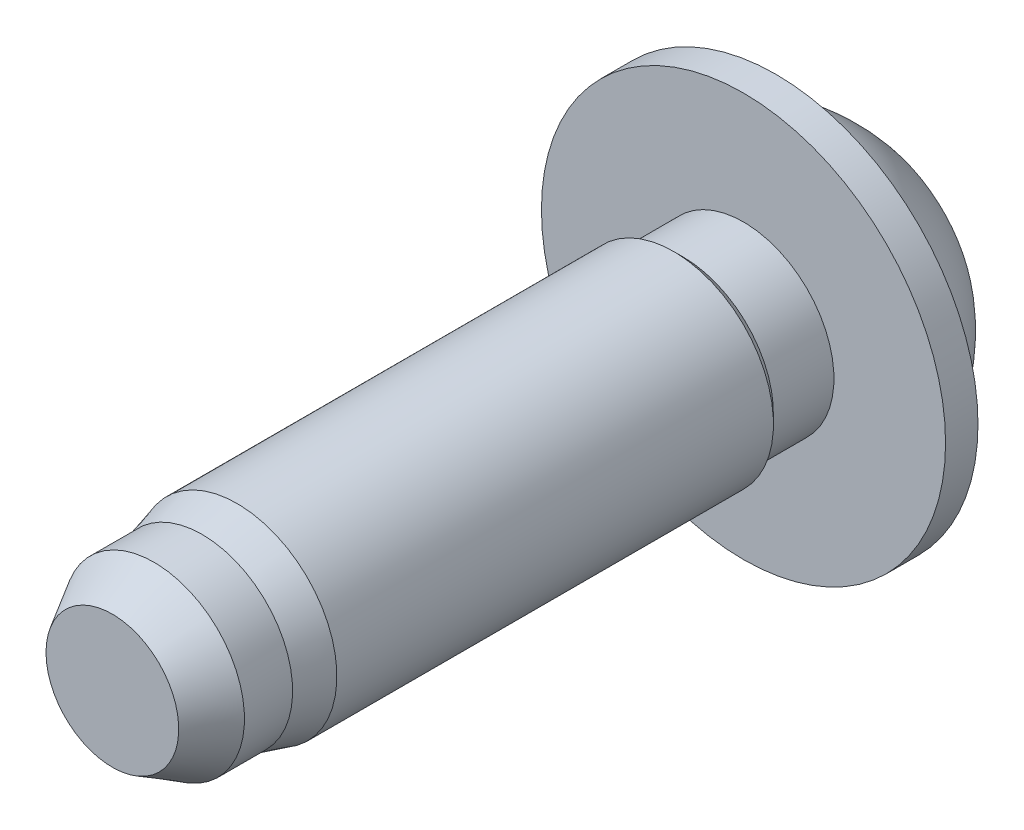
ISO-10303-21;
HEADER;
FILE_DESCRIPTION(('STEP AP214'),'2;1');
FILE_NAME('part.step','',(''),(''),'','','');
FILE_SCHEMA(('AUTOMOTIVE_DESIGN { 1 0 10303 214 1 1 1 1 }'));
ENDSEC;
DATA;
#1=APPLICATION_CONTEXT('core data for automotive mechanical design processes');
#2=APPLICATION_PROTOCOL_DEFINITION('international standard','automotive_design',2000,#1);
#3=PRODUCT_CONTEXT('',#1,'mechanical');
#4=PRODUCT('Part','Part','',(#3));
#5=PRODUCT_RELATED_PRODUCT_CATEGORY('part','',(#4));
#6=PRODUCT_DEFINITION_FORMATION('','',#4);
#7=PRODUCT_DEFINITION_CONTEXT('part definition',#1,'design');
#8=PRODUCT_DEFINITION('design','',#6,#7);
#9=PRODUCT_DEFINITION_SHAPE('','',#8);
#10=(LENGTH_UNIT() NAMED_UNIT(*) SI_UNIT(.MILLI.,.METRE.));
#11=(NAMED_UNIT(*) PLANE_ANGLE_UNIT() SI_UNIT($,.RADIAN.));
#12=(NAMED_UNIT(*) SI_UNIT($,.STERADIAN.) SOLID_ANGLE_UNIT());
#13=UNCERTAINTY_MEASURE_WITH_UNIT(LENGTH_MEASURE(1.E-05),#10,'distance_accuracy_value','');
#14=(GEOMETRIC_REPRESENTATION_CONTEXT(3) GLOBAL_UNCERTAINTY_ASSIGNED_CONTEXT((#13)) GLOBAL_UNIT_ASSIGNED_CONTEXT((#10,
#11,#12)) REPRESENTATION_CONTEXT('',''));
#15=CARTESIAN_POINT('',(0.,0.,0.));
#16=DIRECTION('',(0.,0.,1.));
#17=DIRECTION('',(1.,0.,0.));
#18=AXIS2_PLACEMENT_3D('',#15,#16,#17);
#19=CARTESIAN_POINT('',(0.,2.125,-7.2));
#20=DIRECTION('',(0.,0.,-1.));
#21=DIRECTION('',(-1.,0.,0.));
#22=AXIS2_PLACEMENT_3D('',#19,#20,#21);
#23=PLANE('',#22);
#24=CARTESIAN_POINT('',(0.,4.25000000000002,-7.2));
#25=CARTESIAN_POINT('',(-0.238744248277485,4.2499894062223,-7.2));
#26=CARTESIAN_POINT('',(-0.47764761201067,4.22981662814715,-7.2));
#27=CARTESIAN_POINT('',(-0.948858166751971,4.14962735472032,-7.2));
#28=CARTESIAN_POINT('',(-1.18115777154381,4.08956682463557,-7.2));
#29=CARTESIAN_POINT('',(-1.6322946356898,3.93131128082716,-7.2));
#30=CARTESIAN_POINT('',(-1.85113752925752,3.83313235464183,-7.2));
#31=CARTESIAN_POINT('',(-2.26917057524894,3.60145311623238,-7.2));
#32=CARTESIAN_POINT('',(-2.46836585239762,3.46796204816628,-7.2));
#33=CARTESIAN_POINT('',(-2.84152308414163,3.16943800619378,-7.2));
#34=CARTESIAN_POINT('',(-3.01548503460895,3.00440502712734,-7.2));
#35=CARTESIAN_POINT('',(-3.33327895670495,2.64742616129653,-7.2));
#36=CARTESIAN_POINT('',(-3.47710304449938,2.45547325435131,-7.2));
#37=CARTESIAN_POINT('',(-3.73053094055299,2.05008024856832,-7.2));
#38=CARTESIAN_POINT('',(-3.8401203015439,1.83663112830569,-7.2));
#39=CARTESIAN_POINT('',(-4.02179290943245,1.39451740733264,-7.2));
#40=CARTESIAN_POINT('',(-4.09391741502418,1.16586985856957,-7.2));
#41=CARTESIAN_POINT('',(-4.18076600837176,0.779963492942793,-7.2));
#42=CARTESIAN_POINT('',(-4.20669445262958,0.625133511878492,-7.2));
#43=CARTESIAN_POINT('',(-4.24131464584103,0.313558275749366,-7.2));
#44=CARTESIAN_POINT('',(-4.25000641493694,0.156813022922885,-7.2));
#45=CARTESIAN_POINT('',(-4.24999023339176,-0.238744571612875,-7.19999999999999));
#46=CARTESIAN_POINT('',(-4.22981857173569,-0.477646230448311,-7.2));
#47=CARTESIAN_POINT('',(-4.1496252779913,-0.948860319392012,-7.2));
#48=CARTESIAN_POINT('',(-4.08955966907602,-1.181165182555,-7.2));
#49=CARTESIAN_POINT('',(-3.93131975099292,-1.63228347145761,-7.2));
#50=CARTESIAN_POINT('',(-3.83316215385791,-1.85110276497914,-7.2));
#51=CARTESIAN_POINT('',(-3.60143144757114,-2.26919067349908,-7.2));
#52=CARTESIAN_POINT('',(-3.46786636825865,-2.46846370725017,-7.2));
#53=CARTESIAN_POINT('',(-3.24402964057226,-2.74829388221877,-7.2));
#54=CARTESIAN_POINT('',(-3.16544980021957,-2.83843775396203,-7.2));
#55=CARTESIAN_POINT('',(-3.00098730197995,-3.01178048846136,-7.2));
#56=CARTESIAN_POINT('',(-2.91510734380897,-3.09498189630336,-7.2));
#57=CARTESIAN_POINT('',(-2.73661338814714,-3.25388042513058,-7.2));
#58=CARTESIAN_POINT('',(-2.64399667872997,-3.32957449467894,-7.2));
#59=CARTESIAN_POINT('',(-2.45274881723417,-3.47286516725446,-7.2));
#60=CARTESIAN_POINT('',(-2.35411989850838,-3.54046474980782,-7.2));
#61=CARTESIAN_POINT('',(-2.15148327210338,-3.66713818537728,-7.2));
#62=CARTESIAN_POINT('',(-2.04747367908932,-3.72620902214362,-7.2));
#63=CARTESIAN_POINT('',(-1.83488638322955,-3.835356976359,-7.2));
#64=CARTESIAN_POINT('',(-1.72631038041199,-3.88543740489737,-7.2));
#65=CARTESIAN_POINT('',(-1.50528555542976,-3.97629190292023,-7.2));
#66=CARTESIAN_POINT('',(-1.39283532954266,-4.01706255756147,-7.2));
#67=CARTESIAN_POINT('',(-1.16494164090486,-4.08897081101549,-7.2));
#68=CARTESIAN_POINT('',(-1.04949929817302,-4.12011195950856,-7.2));
#69=CARTESIAN_POINT('',(-0.816358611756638,-4.17257001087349,-7.2));
#70=CARTESIAN_POINT('',(-0.698659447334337,-4.19388326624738,-7.2));
#71=CARTESIAN_POINT('',(-0.461927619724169,-4.22651088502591,-7.2));
#72=CARTESIAN_POINT('',(-0.342895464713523,-4.23782893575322,-7.2));
#73=CARTESIAN_POINT('',(-0.104256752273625,-4.25040143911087,-7.2));
#74=CARTESIAN_POINT('',(0.0153500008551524,-4.25165217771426,-7.2));
#75=CARTESIAN_POINT('',(0.25419940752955,-4.24407281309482,-7.2));
#76=CARTESIAN_POINT('',(0.373442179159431,-4.23524643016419,-7.2));
#77=CARTESIAN_POINT('',(0.610803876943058,-4.20757653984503,-7.2));
#78=CARTESIAN_POINT('',(0.728922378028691,-4.18872938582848,-7.2));
#79=CARTESIAN_POINT('',(0.963108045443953,-4.1411585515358,-7.2));
#80=CARTESIAN_POINT('',(1.07917595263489,-4.11243851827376,-7.2));
#81=CARTESIAN_POINT('',(1.30852390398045,-4.04531174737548,-7.2));
#82=CARTESIAN_POINT('',(1.42180287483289,-4.00690134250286,-7.2));
#83=CARTESIAN_POINT('',(1.64468041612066,-3.92068846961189,-7.2));
#84=CARTESIAN_POINT('',(1.75428032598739,-3.87288946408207,-7.2));
#85=CARTESIAN_POINT('',(1.96910137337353,-3.76821181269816,-7.2));
#86=CARTESIAN_POINT('',(2.07432101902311,-3.71133010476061,-7.2));
#87=CARTESIAN_POINT('',(2.27956855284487,-3.58891958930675,-7.2));
#88=CARTESIAN_POINT('',(2.37959763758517,-3.52339278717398,-7.2));
#89=CARTESIAN_POINT('',(2.57374111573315,-3.38417083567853,-7.2));
#90=CARTESIAN_POINT('',(2.66785816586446,-3.31047939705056,-7.2));
#91=CARTESIAN_POINT('',(2.84962413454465,-3.15538397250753,-7.2));
#92=CARTESIAN_POINT('',(2.93726672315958,-3.07397261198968,-7.2));
#93=CARTESIAN_POINT('',(3.18931001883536,-2.8191748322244,-7.2));
#94=CARTESIAN_POINT('',(3.34308353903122,-2.63503983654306,-7.2));
#95=CARTESIAN_POINT('',(3.61747777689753,-2.24354460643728,-7.2));
#96=CARTESIAN_POINT('',(3.73809975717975,-2.03618525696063,-7.2));
#97=CARTESIAN_POINT('',(3.89167461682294,-1.71223309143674,-7.2));
#98=CARTESIAN_POINT('',(3.93834574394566,-1.60195786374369,-7.2));
#99=CARTESIAN_POINT('',(4.02219976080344,-1.37792725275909,-7.2));
#100=CARTESIAN_POINT('',(4.05939032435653,-1.26417476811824,-7.2));
#101=CARTESIAN_POINT('',(4.12399424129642,-1.03413266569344,-7.2));
#102=CARTESIAN_POINT('',(4.15142302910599,-0.917847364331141,-7.2));
#103=CARTESIAN_POINT('',(4.19639104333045,-0.683402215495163,-7.2));
#104=CARTESIAN_POINT('',(4.21393321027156,-0.56524293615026,-7.2));
#105=CARTESIAN_POINT('',(4.23430872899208,-0.372417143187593,-7.2));
#106=CARTESIAN_POINT('',(4.24019110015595,-0.298059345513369,-7.2));
#107=CARTESIAN_POINT('',(4.2480369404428,-0.14913717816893,-7.2));
#108=CARTESIAN_POINT('',(4.25000040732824,-0.0745728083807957,-7.2));
#109=CARTESIAN_POINT('',(4.24999934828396,0.119314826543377,-7.2));
#110=CARTESIAN_POINT('',(4.24497131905,0.23865125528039,-7.2));
#111=CARTESIAN_POINT('',(4.22488837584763,0.476524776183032,-7.2));
#112=CARTESIAN_POINT('',(4.20982854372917,0.59506144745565,-7.2));
#113=CARTESIAN_POINT('',(4.1697503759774,0.830651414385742,-7.2));
#114=CARTESIAN_POINT('',(4.14471502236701,0.94770182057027,-7.2));
#115=CARTESIAN_POINT('',(4.08485288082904,1.17931772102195,-7.2));
#116=CARTESIAN_POINT('',(4.05002240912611,1.29388226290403,-7.2));
#117=CARTESIAN_POINT('',(3.97086945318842,1.51953092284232,-7.2));
#118=CARTESIAN_POINT('',(3.9265583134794,1.63061902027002,-7.2));
#119=CARTESIAN_POINT('',(3.82871649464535,1.84870744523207,-7.2));
#120=CARTESIAN_POINT('',(3.77518241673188,1.95570624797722,-7.2));
#121=CARTESIAN_POINT('',(3.65933780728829,2.16471958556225,-7.2));
#122=CARTESIAN_POINT('',(3.5970350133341,2.26673840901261,-7.2));
#123=CARTESIAN_POINT('',(3.46403577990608,2.46520403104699,-7.2));
#124=CARTESIAN_POINT('',(3.39333625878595,2.56164876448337,-7.2));
#125=CARTESIAN_POINT('',(3.24408411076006,2.74821477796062,-7.2));
#126=CARTESIAN_POINT('',(3.16553362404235,2.83833776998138,-7.2));
#127=CARTESIAN_POINT('',(3.00109355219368,3.01168011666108,-7.2));
#128=CARTESIAN_POINT('',(2.91520124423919,3.09489688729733,-7.2));
#129=CARTESIAN_POINT('',(2.73670818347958,3.25379745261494,-7.2));
#130=CARTESIAN_POINT('',(2.64410778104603,3.32948164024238,-7.2));
#131=CARTESIAN_POINT('',(2.45285580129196,3.47279461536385,-7.2));
#132=CARTESIAN_POINT('',(2.3542020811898,3.54042052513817,-7.2));
#133=CARTESIAN_POINT('',(2.05018949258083,3.73044527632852,-7.2));
#134=CARTESIAN_POINT('',(1.83665846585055,3.84009841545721,-7.2));
#135=CARTESIAN_POINT('',(1.39448653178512,4.02181623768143,-7.2));
#136=CARTESIAN_POINT('',(1.16586268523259,4.09392257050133,-7.2));
#137=CARTESIAN_POINT('',(0.779967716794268,4.1807627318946,-7.2));
#138=CARTESIAN_POINT('',(0.625134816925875,4.20669346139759,-7.2));
#139=CARTESIAN_POINT('',(0.313557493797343,4.24131557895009,-7.2));
#140=CARTESIAN_POINT('',(0.156813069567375,4.25000695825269,-7.2));
#141=CARTESIAN_POINT('',(0.,4.25000000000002,-7.2));
#142=B_SPLINE_CURVE_WITH_KNOTS('',3,(#24,#25,#26,#27,#28,#29,#30,#31,#32,#33,#34,#35,#36,#37,
#38,#39,#40,#41,#42,#43,#44,#45,#46,#47,#48,#49,#50,#51,#52,#53,#54,#55,#56,#57,#58,#59,#60,#61,
#62,#63,#64,#65,#66,#67,#68,#69,#70,#71,#72,#73,#74,#75,#76,#77,#78,#79,#80,#81,#82,#83,#84,#85,
#86,#87,#88,#89,#90,#91,#92,#93,#94,#95,#96,#97,#98,#99,#100,#101,#102,#103,#104,#105,#106,#107,
#108,#109,#110,#111,#112,#113,#114,#115,#116,#117,#118,#119,#120,#121,#122,#123,#124,#125,#126,
#127,#128,#129,#130,#131,#132,#133,#134,#135,#136,#137,#138,#139,#140,#141),.UNSPECIFIED.,.T.,
.F.,(4,2,2,2,2,2,2,2,2,2,2,2,2,2,2,2,2,2,2,2,2,2,2,2,2,2,2,2,2,2,2,2,2,2,2,2,2,2,2,2,2,2,2,2,2,
2,2,2,2,2,2,2,2,2,2,2,2,2,4),(0.,0.715663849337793,1.43211908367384,2.14827227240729,
2.864238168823,3.58020418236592,4.29635725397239,5.01281213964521,5.72847633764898,
6.19854203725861,6.66860718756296,7.38427161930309,8.1007262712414,8.81686694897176,
9.53284535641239,9.89125327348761,10.2495292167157,10.6079501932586,10.9662388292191,
11.3246538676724,11.682936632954,12.041350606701,12.3996323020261,12.7580468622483,
13.1163291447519,13.4747435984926,13.8330257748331,14.1914384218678,14.5497188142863,
14.9081349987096,15.2664192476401,15.6248245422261,15.9831468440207,16.3413069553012,
16.6998127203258,17.4158859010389,18.1319318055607,18.4908101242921,18.8493970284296,
19.2074144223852,19.5653252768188,19.789000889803,20.0126766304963,20.3705528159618,
20.7286045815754,21.087269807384,21.4460701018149,21.8044434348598,22.1629491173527,
22.5211404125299,22.8794635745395,23.2376893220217,23.5960485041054,23.95438898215,
24.3128570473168,25.0293148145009,25.7449761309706,26.2150414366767,26.6851069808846),.UNSPECIFIED.);
#143=CARTESIAN_POINT('',(0.,4.25000000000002,-7.2));
#144=VERTEX_POINT('',#143);
#145=EDGE_CURVE('E17',#144,#144,#142,.T.);
#146=ORIENTED_EDGE('',*,*,#145,.F.);
#147=EDGE_LOOP('',(#146));
#148=FACE_BOUND('',#147,.T.);
#149=ADVANCED_FACE('F13',(#148),#23,.T.);
#150=CARTESIAN_POINT('',(0.,0.,-1.9043918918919));
#151=DIRECTION('',(1.,0.,0.));
#152=DIRECTION('',(0.,1.,0.));
#153=AXIS2_PLACEMENT_3D('',#150,#151,#152);
#154=SPHERICAL_SURFACE('',#153,6.79013735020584);
#155=ORIENTED_EDGE('',*,*,#145,.T.);
#156=EDGE_LOOP('',(#155));
#157=FACE_BOUND('',#156,.T.);
#158=CARTESIAN_POINT('',(-6.60000000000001,0.,-3.5));
#159=CARTESIAN_POINT('',(-6.60000071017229,-0.227884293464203,-3.5));
#160=CARTESIAN_POINT('',(-6.58818888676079,-0.455757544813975,-3.5));
#161=CARTESIAN_POINT('',(-6.54104360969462,-0.909253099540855,-3.5));
#162=CARTESIAN_POINT('',(-6.50569252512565,-1.13487358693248,-3.5));
#163=CARTESIAN_POINT('',(-6.42061817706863,-1.53950406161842,-3.5));
#164=CARTESIAN_POINT('',(-6.37481221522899,-1.7193493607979,-3.5));
#165=CARTESIAN_POINT('',(-6.26820682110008,-2.07460235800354,-3.5));
#166=CARTESIAN_POINT('',(-6.20740357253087,-2.25000891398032,-3.5));
#167=CARTESIAN_POINT('',(-6.07119211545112,-2.59520398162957,-3.5));
#168=CARTESIAN_POINT('',(-5.9957730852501,-2.76498822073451,-3.5));
#169=CARTESIAN_POINT('',(-5.83086504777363,-3.09765883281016,-3.5));
#170=CARTESIAN_POINT('',(-5.74137090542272,-3.26054266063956,-3.5));
#171=CARTESIAN_POINT('',(-5.54904489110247,-3.57806181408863,-3.5));
#172=CARTESIAN_POINT('',(-5.44622346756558,-3.73270346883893,-3.5));
#173=CARTESIAN_POINT('',(-5.22787926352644,-4.03283134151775,-3.5));
#174=CARTESIAN_POINT('',(-5.11235181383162,-4.1783141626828,-3.5));
#175=CARTESIAN_POINT('',(-4.869520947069,-4.45894328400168,-3.5));
#176=CARTESIAN_POINT('',(-4.74222459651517,-4.59409569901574,-3.5));
#177=CARTESIAN_POINT('',(-4.47665287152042,-4.85324774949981,-3.5));
#178=CARTESIAN_POINT('',(-4.33837346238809,-4.97724325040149,-3.5));
#179=CARTESIAN_POINT('',(-4.05189928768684,-5.21311116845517,-3.5));
#180=CARTESIAN_POINT('',(-3.90370725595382,-5.32498690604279,-3.5));
#181=CARTESIAN_POINT('',(-3.59837055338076,-5.53589835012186,-3.5));
#182=CARTESIAN_POINT('',(-3.44122259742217,-5.63492930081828,-3.5));
#183=CARTESIAN_POINT('',(-3.1191946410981,-5.81936795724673,-3.5));
#184=CARTESIAN_POINT('',(-2.95431720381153,-5.90478013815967,-3.5));
#185=CARTESIAN_POINT('',(-2.61789209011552,-6.06144247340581,-3.5));
#186=CARTESIAN_POINT('',(-2.44634198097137,-6.13268740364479,-3.5));
#187=CARTESIAN_POINT('',(-2.09788587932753,-6.26045558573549,-3.5));
#188=CARTESIAN_POINT('',(-1.9209810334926,-6.31698196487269,-3.5));
#189=CARTESIAN_POINT('',(-1.56303448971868,-6.41493210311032,-3.5));
#190=CARTESIAN_POINT('',(-1.38199270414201,-6.45635554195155,-3.5));
#191=CARTESIAN_POINT('',(-1.01706554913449,-6.52380314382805,-3.5));
#192=CARTESIAN_POINT('',(-0.833180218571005,-6.54982751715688,-3.5));
#193=CARTESIAN_POINT('',(-0.463870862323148,-6.5862928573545,-3.5));
#194=CARTESIAN_POINT('',(-0.27844683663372,-6.59673382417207,-3.5));
#195=CARTESIAN_POINT('',(0.0926237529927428,-6.6019581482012,-3.5));
#196=CARTESIAN_POINT('',(0.278270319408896,-6.59674132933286,-3.5));
#197=CARTESIAN_POINT('',(0.648460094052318,-6.57068707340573,-3.5));
#198=CARTESIAN_POINT('',(0.833003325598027,-6.54984996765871,-3.5));
#199=CARTESIAN_POINT('',(1.19971452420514,-6.49269802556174,-3.5));
#200=CARTESIAN_POINT('',(1.3818820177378,-6.45638015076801,-3.5));
#201=CARTESIAN_POINT('',(1.74244271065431,-6.36854070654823,-3.5));
#202=CARTESIAN_POINT('',(1.92083727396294,-6.31702473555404,-3.5));
#203=CARTESIAN_POINT('',(2.27272071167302,-6.19912768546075,-3.5));
#204=CARTESIAN_POINT('',(2.44620768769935,-6.13274094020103,-3.5));
#205=CARTESIAN_POINT('',(2.78690803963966,-5.98561289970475,-3.5));
#206=CARTESIAN_POINT('',(2.95412370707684,-5.9048769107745,-3.5));
#207=CARTESIAN_POINT('',(3.2812165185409,-5.72957762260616,-3.5));
#208=CARTESIAN_POINT('',(3.44109113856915,-5.63500961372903,-3.5));
#209=CARTESIAN_POINT('',(3.75224636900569,-5.43277677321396,-3.5));
#210=CARTESIAN_POINT('',(3.90353012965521,-5.32511678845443,-3.5));
#211=CARTESIAN_POINT('',(4.19653659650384,-5.09740301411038,-3.5));
#212=CARTESIAN_POINT('',(4.33825640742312,-4.97734549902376,-3.5));
#213=CARTESIAN_POINT('',(4.61102678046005,-4.72576381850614,-3.5));
#214=CARTESIAN_POINT('',(4.74208125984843,-4.59424390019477,-3.5));
#215=CARTESIAN_POINT('',(4.99271480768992,-4.32056095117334,-3.5));
#216=CARTESIAN_POINT('',(5.11228772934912,-4.17839229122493,-3.5));
#217=CARTESIAN_POINT('',(5.33898663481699,-3.88453919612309,-3.5));
#218=CARTESIAN_POINT('',(5.44611719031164,-3.73285828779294,-3.5));
#219=CARTESIAN_POINT('',(5.64727496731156,-3.42092745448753,-3.5));
#220=CARTESIAN_POINT('',(5.74129512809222,-3.26067297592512,-3.5));
#221=CARTESIAN_POINT('',(5.91548484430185,-2.93283012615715,-3.5));
#222=CARTESIAN_POINT('',(5.99565597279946,-2.76524259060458,-3.5));
#223=CARTESIAN_POINT('',(6.14152347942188,-2.4240613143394,-3.5));
#224=CARTESIAN_POINT('',(6.2072331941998,-2.25047327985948,-3.5));
#225=CARTESIAN_POINT('',(6.32382960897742,-1.89831751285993,-3.5));
#226=CARTESIAN_POINT('',(6.37470949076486,-1.71974753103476,-3.5));
#227=CARTESIAN_POINT('',(6.47837235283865,-1.28751927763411,-3.5));
#228=CARTESIAN_POINT('',(6.5239463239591,-1.03210079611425,-3.5));
#229=CARTESIAN_POINT('',(6.58475244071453,-0.517743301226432,-3.5));
#230=CARTESIAN_POINT('',(6.59999635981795,-0.258805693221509,-3.5));
#231=CARTESIAN_POINT('',(6.60000160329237,0.113989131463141,-3.5));
#232=CARTESIAN_POINT('',(6.59704674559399,0.227952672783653,-3.5));
#233=CARTESIAN_POINT('',(6.58524680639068,0.455521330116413,-3.5));
#234=CARTESIAN_POINT('',(6.57640450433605,0.569126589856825,-3.5));
#235=CARTESIAN_POINT('',(6.54104367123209,0.909224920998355,-3.5));
#236=CARTESIAN_POINT('',(6.50569123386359,1.13487175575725,-3.5));
#237=CARTESIAN_POINT('',(6.42061796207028,1.53951156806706,-3.5));
#238=CARTESIAN_POINT('',(6.3748130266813,1.71934805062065,-3.5));
#239=CARTESIAN_POINT('',(6.26820963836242,2.07459157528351,-3.5));
#240=CARTESIAN_POINT('',(6.20740742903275,2.24999749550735,-3.5));
#241=CARTESIAN_POINT('',(6.07119666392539,2.59519410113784,-3.5));
#242=CARTESIAN_POINT('',(5.99577686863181,2.7649803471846,-3.5));
#243=CARTESIAN_POINT('',(5.83086708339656,3.09765496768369,-3.5));
#244=CARTESIAN_POINT('',(5.74137199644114,3.26054081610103,-3.5));
#245=CARTESIAN_POINT('',(5.54904347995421,3.57806418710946,-3.5));
#246=CARTESIAN_POINT('',(5.44622045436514,3.73270801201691,-3.5));
#247=CARTESIAN_POINT('',(5.22787274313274,4.03283990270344,-3.5));
#248=CARTESIAN_POINT('',(5.11234339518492,4.17832457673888,-3.5));
#249=CARTESIAN_POINT('',(4.86951197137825,4.45895297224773,-3.5));
#250=CARTESIAN_POINT('',(4.74221730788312,4.59410310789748,-3.5));
#251=CARTESIAN_POINT('',(4.47664910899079,4.85325112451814,-3.5));
#252=CARTESIAN_POINT('',(4.33837152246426,4.97724485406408,-3.5));
#253=CARTESIAN_POINT('',(4.05190841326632,5.2131036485,-3.5));
#254=CARTESIAN_POINT('',(3.90372612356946,5.32497264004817,-3.5));
#255=CARTESIAN_POINT('',(3.59841111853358,5.53587156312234,-3.5));
#256=CARTESIAN_POINT('',(3.44127517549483,5.63489682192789,-3.5));
#257=CARTESIAN_POINT('',(3.11922253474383,5.81935434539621,-3.5));
#258=CARTESIAN_POINT('',(2.95430603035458,5.9047869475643,-3.5));
#259=CARTESIAN_POINT('',(2.61785822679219,6.06145663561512,-3.5));
#260=CARTESIAN_POINT('',(2.44632670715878,6.13269324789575,-3.5));
#261=CARTESIAN_POINT('',(2.09062229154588,6.26311866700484,-3.5));
#262=CARTESIAN_POINT('',(1.90622030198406,6.3216836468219,-3.5));
#263=CARTESIAN_POINT('',(1.53297909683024,6.42240939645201,-3.5));
#264=CARTESIAN_POINT('',(1.34413960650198,6.46456914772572,-3.5));
#265=CARTESIAN_POINT('',(0.963526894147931,6.53214872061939,-3.5));
#266=CARTESIAN_POINT('',(0.771754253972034,6.55757181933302,-3.5));
#267=CARTESIAN_POINT('',(0.38665329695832,6.59150008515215,-3.5));
#268=CARTESIAN_POINT('',(0.193324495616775,6.59999976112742,-3.5));
#269=CARTESIAN_POINT('',(-0.185568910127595,6.60000022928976,-3.5));
#270=CARTESIAN_POINT('',(-0.371133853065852,6.59216928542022,-3.5));
#271=CARTESIAN_POINT('',(-0.74094342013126,6.56090199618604,-3.5));
#272=CARTESIAN_POINT('',(-0.925188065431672,6.53746590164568,-3.5));
#273=CARTESIAN_POINT('',(-1.29105595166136,6.4751534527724,-3.5));
#274=CARTESIAN_POINT('',(-1.47267906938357,6.43627637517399,-3.5));
#275=CARTESIAN_POINT('',(-1.83194299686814,6.34337436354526,-3.5));
#276=CARTESIAN_POINT('',(-2.00958514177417,6.28935459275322,-3.5));
#277=CARTESIAN_POINT('',(-2.35976314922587,6.16651934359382,-3.5));
#278=CARTESIAN_POINT('',(-2.53229680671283,6.09769757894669,-3.5));
#279=CARTESIAN_POINT('',(-2.87088894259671,5.94578961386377,-3.5));
#280=CARTESIAN_POINT('',(-3.0369497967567,5.86270870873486,-3.5));
#281=CARTESIAN_POINT('',(-3.36154253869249,5.68282271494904,-3.5));
#282=CARTESIAN_POINT('',(-3.52007168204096,5.58601267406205,-3.5));
#283=CARTESIAN_POINT('',(-3.82835233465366,5.37941775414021,-3.5));
#284=CARTESIAN_POINT('',(-3.97810705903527,5.26963767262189,-3.5));
#285=CARTESIAN_POINT('',(-4.2678783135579,5.0378220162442,-3.5));
#286=CARTESIAN_POINT('',(-4.40789212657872,4.91578304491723,-3.5));
#287=CARTESIAN_POINT('',(-4.67709043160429,4.66039009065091,-3.5));
#288=CARTESIAN_POINT('',(-4.80627890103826,4.52704030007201,-3.5));
#289=CARTESIAN_POINT('',(-5.05303542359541,4.24985670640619,-3.5));
#290=CARTESIAN_POINT('',(-5.17059693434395,4.10601707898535,-3.5));
#291=CARTESIAN_POINT('',(-5.39313996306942,3.80899794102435,-3.5));
#292=CARTESIAN_POINT('',(-5.49812610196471,3.65582189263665,-3.5));
#293=CARTESIAN_POINT('',(-5.69487985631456,3.34107868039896,-3.5));
#294=CARTESIAN_POINT('',(-5.78663973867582,3.17950668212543,-3.5));
#295=CARTESIAN_POINT('',(-5.95620708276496,2.84922025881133,-3.5));
#296=CARTESIAN_POINT('',(-6.03401584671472,2.68050650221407,-3.5));
#297=CARTESIAN_POINT('',(-6.17506544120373,2.33729522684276,-3.5));
#298=CARTESIAN_POINT('',(-6.23832124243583,2.16280386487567,-3.5));
#299=CARTESIAN_POINT('',(-6.34993771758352,1.80906425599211,-3.5));
#300=CARTESIAN_POINT('',(-6.39829279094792,1.62981424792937,-3.5));
#301=CARTESIAN_POINT('',(-6.49245863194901,1.2112891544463,-3.5));
#302=CARTESIAN_POINT('',(-6.5327576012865,0.970752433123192,-3.5));
#303=CARTESIAN_POINT('',(-6.58652304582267,0.486805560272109,-3.5));
#304=CARTESIAN_POINT('',(-6.59999924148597,0.243396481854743,-3.5));
#305=CARTESIAN_POINT('',(-6.60000000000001,0.,-3.5));
#306=B_SPLINE_CURVE_WITH_KNOTS('',3,(#158,#159,#160,#161,#162,#163,#164,#165,#166,#167,#168,
#169,#170,#171,#172,#173,#174,#175,#176,#177,#178,#179,#180,#181,#182,#183,#184,#185,#186,#187,
#188,#189,#190,#191,#192,#193,#194,#195,#196,#197,#198,#199,#200,#201,#202,#203,#204,#205,#206,
#207,#208,#209,#210,#211,#212,#213,#214,#215,#216,#217,#218,#219,#220,#221,#222,#223,#224,#225,
#226,#227,#228,#229,#230,#231,#232,#233,#234,#235,#236,#237,#238,#239,#240,#241,#242,#243,#244,
#245,#246,#247,#248,#249,#250,#251,#252,#253,#254,#255,#256,#257,#258,#259,#260,#261,#262,#263,
#264,#265,#266,#267,#268,#269,#270,#271,#272,#273,#274,#275,#276,#277,#278,#279,#280,#281,#282,
#283,#284,#285,#286,#287,#288,#289,#290,#291,#292,#293,#294,#295,#296,#297,#298,#299,#300,#301,
#302,#303,#304,#305),.UNSPECIFIED.,.T.,.F.,(4,2,2,2,2,2,2,2,2,2,2,2,2,2,2,2,2,2,2,2,2,2,2,2,2,2,
2,2,2,2,2,2,2,2,2,2,2,2,2,2,2,2,2,2,2,2,2,2,2,2,2,2,2,2,2,2,2,2,2,2,2,2,2,2,2,2,2,2,2,2,2,2,2,
4),(0.,0.683336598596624,1.36718559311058,1.92331566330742,2.47958739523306,3.03627258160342,
3.59316133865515,4.14961611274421,4.70627605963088,5.26260391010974,5.8191370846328,
6.37551739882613,6.93210312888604,7.48850558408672,8.04511283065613,8.60160171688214,
9.15810240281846,9.71459548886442,10.2710885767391,10.8275879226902,11.3840754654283,
11.9406722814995,12.4970643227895,13.0536687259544,13.6100677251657,14.1666566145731,
14.7230400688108,15.2795912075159,15.8359369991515,16.3925789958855,16.949015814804,
17.5057511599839,18.0624232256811,18.618579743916,19.1749915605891,19.9515083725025,
20.7277236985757,21.0696022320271,21.4113194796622,22.0951385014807,22.6512626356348,
23.2075262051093,23.7642191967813,24.3211142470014,24.8775771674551,25.4342449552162,
25.9905643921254,26.5470899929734,27.1034348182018,27.6599814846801,28.2165143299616,
28.7730657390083,29.3527498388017,29.9324699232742,30.5120764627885,31.0918710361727,
31.6484060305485,32.2049320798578,32.7614842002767,33.3178467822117,33.8744461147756,
34.4308391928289,34.9874334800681,35.543822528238,36.1003661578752,36.6567043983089,
37.2133539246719,37.7697982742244,38.3265666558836,38.8832830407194,39.4394241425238,
39.9957740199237,40.7258902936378,41.4557419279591),.UNSPECIFIED.);
#307=CARTESIAN_POINT('',(-6.60000000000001,0.,-3.5));
#308=VERTEX_POINT('',#307);
#309=EDGE_CURVE('E53',#308,#308,#306,.T.);
#310=ORIENTED_EDGE('',*,*,#309,.F.);
#311=EDGE_LOOP('',(#310));
#312=FACE_BOUND('',#311,.T.);
#313=ADVANCED_FACE('F44',(#157,#312),#154,.T.);
#314=CARTESIAN_POINT('',(0.,7.35,-3.5));
#315=DIRECTION('',(0.,0.,-1.));
#316=DIRECTION('',(-1.,0.,0.));
#317=AXIS2_PLACEMENT_3D('',#314,#315,#316);
#318=PLANE('',#317);
#319=ORIENTED_EDGE('',*,*,#309,.T.);
#320=EDGE_LOOP('',(#319));
#321=FACE_BOUND('',#320,.T.);
#322=CARTESIAN_POINT('',(0.,0.,-3.5));
#323=DIRECTION('',(0.,0.,-1.));
#324=DIRECTION('',(-1.,0.,0.));
#325=AXIS2_PLACEMENT_3D('',#322,#323,#324);
#326=CIRCLE('',#325,8.1);
#327=CARTESIAN_POINT('',(-8.1,0.,-3.5));
#328=VERTEX_POINT('',#327);
#329=EDGE_CURVE('E59',#328,#328,#326,.F.);
#330=ORIENTED_EDGE('',*,*,#329,.F.);
#331=EDGE_LOOP('',(#330));
#332=FACE_BOUND('',#331,.T.);
#333=ADVANCED_FACE('F48',(#321,#332),#318,.T.);
#334=CARTESIAN_POINT('',(0.,0.,-2.85));
#335=DIRECTION('',(0.,0.,-1.));
#336=DIRECTION('',(-1.,0.,0.));
#337=AXIS2_PLACEMENT_3D('',#334,#335,#336);
#338=CYLINDRICAL_SURFACE('',#337,8.1);
#339=CARTESIAN_POINT('',(0.,0.,-2.2));
#340=DIRECTION('',(0.,0.,-1.));
#341=DIRECTION('',(-1.,0.,0.));
#342=AXIS2_PLACEMENT_3D('',#339,#340,#341);
#343=CIRCLE('',#342,8.1);
#344=CARTESIAN_POINT('',(-8.1,0.,-2.2));
#345=VERTEX_POINT('',#344);
#346=EDGE_CURVE('E62',#345,#345,#343,.F.);
#347=ORIENTED_EDGE('',*,*,#346,.F.);
#348=EDGE_LOOP('',(#347));
#349=FACE_BOUND('',#348,.T.);
#350=ORIENTED_EDGE('',*,*,#329,.T.);
#351=EDGE_LOOP('',(#350));
#352=FACE_BOUND('',#351,.T.);
#353=ADVANCED_FACE('F82',(#349,#352),#338,.T.);
#354=CARTESIAN_POINT('',(0.,1.33012701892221,23.1));
#355=DIRECTION('',(0.,0.,1.));
#356=DIRECTION('',(1.,0.,0.));
#357=AXIS2_PLACEMENT_3D('',#354,#355,#356);
#358=PLANE('',#357);
#359=CARTESIAN_POINT('',(0.,0.,23.1000000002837));
#360=DIRECTION('',(0.,0.,-1.));
#361=DIRECTION('',(-1.,0.,0.));
#362=AXIS2_PLACEMENT_3D('',#359,#360,#361);
#363=CIRCLE('',#362,2.66025403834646);
#364=CARTESIAN_POINT('',(-2.66025403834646,0.,23.1000000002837));
#365=VERTEX_POINT('',#364);
#366=EDGE_CURVE('E64',#365,#365,#363,.T.);
#367=ORIENTED_EDGE('',*,*,#366,.F.);
#368=EDGE_LOOP('',(#367));
#369=FACE_BOUND('',#368,.T.);
#370=ADVANCED_FACE('F78',(#369),#358,.T.);
#371=CARTESIAN_POINT('',(0.,5.8625,-2.2));
#372=DIRECTION('',(0.,0.,1.));
#373=DIRECTION('',(1.,0.,0.));
#374=AXIS2_PLACEMENT_3D('',#371,#372,#373);
#375=PLANE('',#374);
#376=CARTESIAN_POINT('',(0.,0.,-2.2));
#377=DIRECTION('',(0.,0.,-1.));
#378=DIRECTION('',(-1.,0.,0.));
#379=AXIS2_PLACEMENT_3D('',#376,#377,#378);
#380=CIRCLE('',#379,3.625);
#381=CARTESIAN_POINT('',(-3.625,0.,-2.2));
#382=VERTEX_POINT('',#381);
#383=EDGE_CURVE('E40',#382,#382,#380,.F.);
#384=ORIENTED_EDGE('',*,*,#383,.F.);
#385=EDGE_LOOP('',(#384));
#386=FACE_BOUND('',#385,.T.);
#387=ORIENTED_EDGE('',*,*,#346,.T.);
#388=EDGE_LOOP('',(#387));
#389=FACE_BOUND('',#388,.T.);
#390=ADVANCED_FACE('F74',(#386,#389),#375,.T.);
#391=CARTESIAN_POINT('',(0.,0.,21.429010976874));
#392=DIRECTION('',(0.,0.,-1.));
#393=DIRECTION('',(-1.,0.,0.));
#394=AXIS2_PLACEMENT_3D('',#391,#392,#393);
#395=CONICAL_SURFACE('',#394,3.62499999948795,0.523598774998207);
#396=CARTESIAN_POINT('',(0.,0.,21.4290109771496));
#397=DIRECTION('',(0.,0.,-1.));
#398=DIRECTION('',(-1.,0.,0.));
#399=AXIS2_PLACEMENT_3D('',#396,#397,#398);
#400=CIRCLE('',#399,3.625);
#401=CARTESIAN_POINT('',(-3.625,0.,21.4290109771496));
#402=VERTEX_POINT('',#401);
#403=EDGE_CURVE('E37',#402,#402,#400,.T.);
#404=ORIENTED_EDGE('',*,*,#403,.F.);
#405=EDGE_LOOP('',(#404));
#406=FACE_BOUND('',#405,.T.);
#407=ORIENTED_EDGE('',*,*,#366,.T.);
#408=EDGE_LOOP('',(#407));
#409=FACE_BOUND('',#408,.T.);
#410=ADVANCED_FACE('F77',(#406,#409),#395,.T.);
#411=CARTESIAN_POINT('',(0.,0.,-0.987499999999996));
#412=DIRECTION('',(0.,0.,-1.));
#413=DIRECTION('',(-1.,0.,0.));
#414=AXIS2_PLACEMENT_3D('',#411,#412,#413);
#415=CYLINDRICAL_SURFACE('',#414,3.625);
#416=ORIENTED_EDGE('',*,*,#383,.T.);
#417=EDGE_LOOP('',(#416));
#418=FACE_BOUND('',#417,.T.);
#419=CARTESIAN_POINT('',(0.,0.,0.22499999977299));
#420=DIRECTION('',(0.,0.,1.));
#421=DIRECTION('',(0.,1.,0.));
#422=AXIS2_PLACEMENT_3D('',#419,#420,#421);
#423=CIRCLE('',#422,3.62500000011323);
#424=CARTESIAN_POINT('',(0.,3.62500000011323,0.22499999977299));
#425=VERTEX_POINT('',#424);
#426=EDGE_CURVE('E34',#425,#425,#423,.T.);
#427=ORIENTED_EDGE('',*,*,#426,.F.);
#428=EDGE_LOOP('',(#427));
#429=FACE_BOUND('',#428,.T.);
#430=ADVANCED_FACE('F71',(#418,#429),#415,.T.);
#431=CARTESIAN_POINT('',(0.,0.,20.464265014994));
#432=DIRECTION('',(0.,0.,-1.));
#433=DIRECTION('',(-1.,0.,0.));
#434=AXIS2_PLACEMENT_3D('',#431,#432,#433);
#435=CYLINDRICAL_SURFACE('',#434,3.625);
#436=CARTESIAN_POINT('',(0.,0.,19.4995190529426));
#437=DIRECTION('',(0.,0.,-1.));
#438=DIRECTION('',(0.,1.,0.));
#439=AXIS2_PLACEMENT_3D('',#436,#437,#438);
#440=CIRCLE('',#439,3.62500000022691);
#441=CARTESIAN_POINT('',(0.,3.62500000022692,19.4995190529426));
#442=VERTEX_POINT('',#441);
#443=EDGE_CURVE('E29',#442,#442,#440,.T.);
#444=ORIENTED_EDGE('',*,*,#443,.F.);
#445=EDGE_LOOP('',(#444));
#446=FACE_BOUND('',#445,.T.);
#447=ORIENTED_EDGE('',*,*,#403,.T.);
#448=EDGE_LOOP('',(#447));
#449=FACE_BOUND('',#448,.T.);
#450=ADVANCED_FACE('F106',(#446,#449),#435,.T.);
#451=CARTESIAN_POINT('',(0.,0.,0.600000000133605));
#452=DIRECTION('',(0.,0.,1.));
#453=DIRECTION('',(1.,0.,0.));
#454=AXIS2_PLACEMENT_3D('',#451,#452,#453);
#455=CONICAL_SURFACE('',#454,3.99999999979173,0.785398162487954);
#456=ORIENTED_EDGE('',*,*,#426,.T.);
#457=EDGE_LOOP('',(#456));
#458=FACE_BOUND('',#457,.T.);
#459=CARTESIAN_POINT('',(0.,0.,0.6));
#460=DIRECTION('',(0.,0.,-1.));
#461=DIRECTION('',(-1.,0.,0.));
#462=AXIS2_PLACEMENT_3D('',#459,#460,#461);
#463=CIRCLE('',#462,4.);
#464=CARTESIAN_POINT('',(-4.,0.,0.6));
#465=VERTEX_POINT('',#464);
#466=EDGE_CURVE('E24',#465,#465,#463,.F.);
#467=ORIENTED_EDGE('',*,*,#466,.F.);
#468=EDGE_LOOP('',(#467));
#469=FACE_BOUND('',#468,.T.);
#470=ADVANCED_FACE('F100',(#458,#469),#455,.T.);
#471=CARTESIAN_POINT('',(0.,0.,18.0999999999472));
#472=DIRECTION('',(0.,0.,-1.));
#473=DIRECTION('',(-1.,0.,0.));
#474=AXIS2_PLACEMENT_3D('',#471,#472,#473);
#475=CONICAL_SURFACE('',#474,3.99999999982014,0.26179938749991);
#476=ORIENTED_EDGE('',*,*,#443,.T.);
#477=EDGE_LOOP('',(#476));
#478=FACE_BOUND('',#477,.T.);
#479=CARTESIAN_POINT('',(0.,0.,18.1));
#480=DIRECTION('',(0.,0.,-1.));
#481=DIRECTION('',(-1.,0.,0.));
#482=AXIS2_PLACEMENT_3D('',#479,#480,#481);
#483=CIRCLE('',#482,4.);
#484=CARTESIAN_POINT('',(-4.,0.,18.1));
#485=VERTEX_POINT('',#484);
#486=EDGE_CURVE('E9',#485,#485,#483,.T.);
#487=ORIENTED_EDGE('',*,*,#486,.F.);
#488=EDGE_LOOP('',(#487));
#489=FACE_BOUND('',#488,.T.);
#490=ADVANCED_FACE('F94',(#478,#489),#475,.T.);
#491=CARTESIAN_POINT('',(0.,0.,9.35));
#492=DIRECTION('',(0.,0.,-1.));
#493=DIRECTION('',(-1.,0.,0.));
#494=AXIS2_PLACEMENT_3D('',#491,#492,#493);
#495=CYLINDRICAL_SURFACE('',#494,4.);
#496=ORIENTED_EDGE('',*,*,#466,.T.);
#497=EDGE_LOOP('',(#496));
#498=FACE_BOUND('',#497,.T.);
#499=ORIENTED_EDGE('',*,*,#486,.T.);
#500=EDGE_LOOP('',(#499));
#501=FACE_BOUND('',#500,.T.);
#502=ADVANCED_FACE('F92',(#498,#501),#495,.T.);
#503=CLOSED_SHELL('',(#149,#313,#333,#353,#370,#390,#410,#430,#450,#470,#490,#502));
#504=MANIFOLD_SOLID_BREP('B1',#503);
#505=ADVANCED_BREP_SHAPE_REPRESENTATION('',(#18,#504),#14);
#506=SHAPE_DEFINITION_REPRESENTATION(#9,#505);
ENDSEC;
END-ISO-10303-21;
